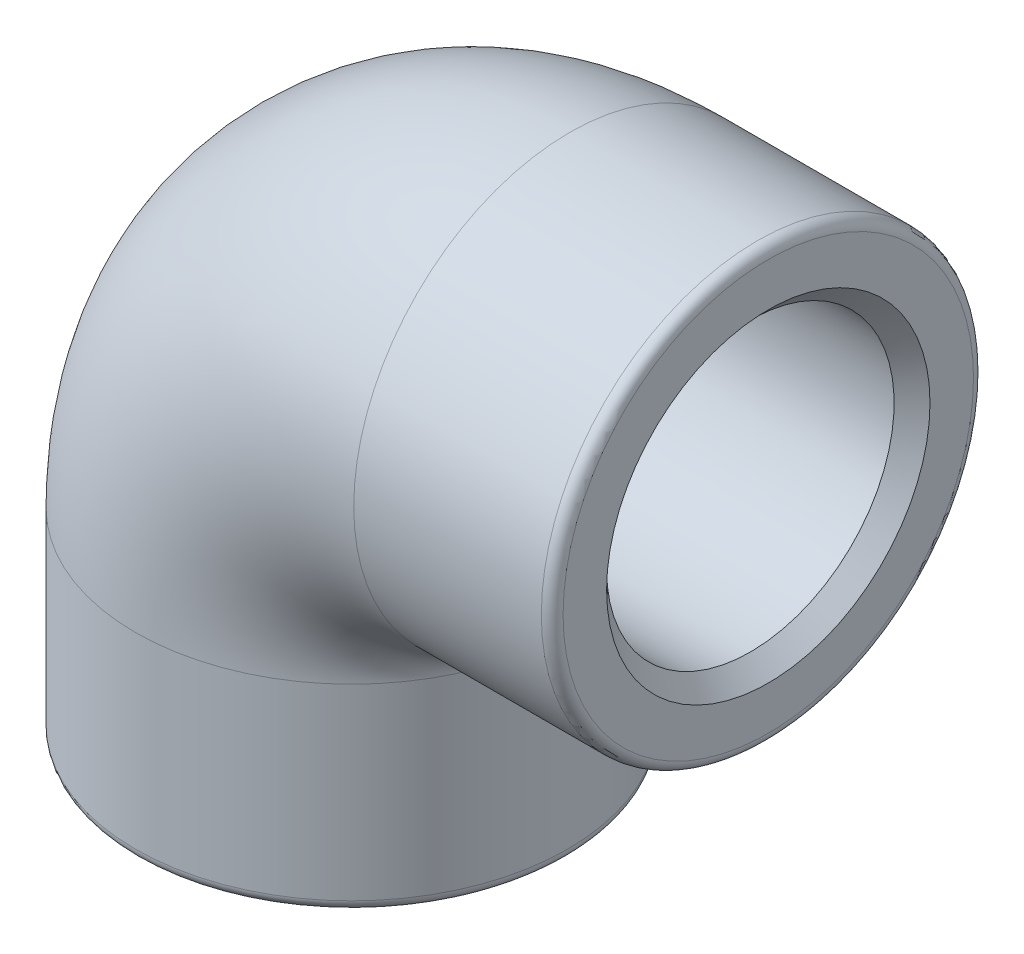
ISO-10303-21;
HEADER;
FILE_DESCRIPTION(('STEP AP214'),'2;1');
FILE_NAME('part.step','',(''),(''),'','','');
FILE_SCHEMA(('AUTOMOTIVE_DESIGN { 1 0 10303 214 1 1 1 1 }'));
ENDSEC;
DATA;
#1=APPLICATION_CONTEXT('core data for automotive mechanical design processes');
#2=APPLICATION_PROTOCOL_DEFINITION('international standard','automotive_design',2000,#1);
#3=PRODUCT_CONTEXT('',#1,'mechanical');
#4=PRODUCT('Part','Part','',(#3));
#5=PRODUCT_RELATED_PRODUCT_CATEGORY('part','',(#4));
#6=PRODUCT_DEFINITION_FORMATION('','',#4);
#7=PRODUCT_DEFINITION_CONTEXT('part definition',#1,'design');
#8=PRODUCT_DEFINITION('design','',#6,#7);
#9=PRODUCT_DEFINITION_SHAPE('','',#8);
#10=(LENGTH_UNIT() NAMED_UNIT(*) SI_UNIT(.MILLI.,.METRE.));
#11=(NAMED_UNIT(*) PLANE_ANGLE_UNIT() SI_UNIT($,.RADIAN.));
#12=(NAMED_UNIT(*) SI_UNIT($,.STERADIAN.) SOLID_ANGLE_UNIT());
#13=UNCERTAINTY_MEASURE_WITH_UNIT(LENGTH_MEASURE(1.E-05),#10,'distance_accuracy_value','');
#14=(GEOMETRIC_REPRESENTATION_CONTEXT(3) GLOBAL_UNCERTAINTY_ASSIGNED_CONTEXT((#13)) GLOBAL_UNIT_ASSIGNED_CONTEXT((#10,
#11,#12)) REPRESENTATION_CONTEXT('',''));
#15=CARTESIAN_POINT('',(0.,0.,0.));
#16=DIRECTION('',(0.,0.,1.));
#17=DIRECTION('',(1.,0.,0.));
#18=AXIS2_PLACEMENT_3D('',#15,#16,#17);
#19=CARTESIAN_POINT('',(0.,0.,0.));
#20=DIRECTION('',(0.,0.,-1.));
#21=DIRECTION('',(0.,-1.,0.));
#22=AXIS2_PLACEMENT_3D('',#19,#20,#21);
#23=TOROIDAL_SURFACE('',#22,14.14,8.38395);
#24=CARTESIAN_POINT('',(-4.64997692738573,7.34869784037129,-6.37626499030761));
#25=CARTESIAN_POINT('',(-4.60202469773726,7.28499093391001,-6.30841495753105));
#26=CARTESIAN_POINT('',(-4.55558740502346,7.22178232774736,-6.23905007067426));
#27=CARTESIAN_POINT('',(-4.46558885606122,7.0966208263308,-6.09739895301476));
#28=CARTESIAN_POINT('',(-4.42202729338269,7.03466779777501,-6.02511303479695));
#29=CARTESIAN_POINT('',(-4.29546328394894,6.85113670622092,-5.80410592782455));
#30=CARTESIAN_POINT('',(-4.21652212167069,6.73180657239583,-5.65115052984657));
#31=CARTESIAN_POINT('',(-4.06851193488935,6.50097817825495,-5.33499866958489));
#32=CARTESIAN_POINT('',(-3.99944105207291,6.38947844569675,-5.1718041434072));
#33=CARTESIAN_POINT('',(-3.87031451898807,6.17566472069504,-4.83606454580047));
#34=CARTESIAN_POINT('',(-3.81026014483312,6.07335202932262,-4.66351815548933));
#35=CARTESIAN_POINT('',(-3.69404039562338,5.87126512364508,-4.29581730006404));
#36=CARTESIAN_POINT('',(-3.63857877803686,5.77236040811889,-4.09996161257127));
#37=CARTESIAN_POINT('',(-3.53687028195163,5.58787462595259,-3.69976367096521));
#38=CARTESIAN_POINT('',(-3.49062375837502,5.5022940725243,-3.49542109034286));
#39=CARTESIAN_POINT('',(-3.40695628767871,5.345472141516,-3.07963679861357));
#40=CARTESIAN_POINT('',(-3.36953206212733,5.27422543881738,-2.86819775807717));
#41=CARTESIAN_POINT('',(-3.30323350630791,5.14683782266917,-2.43958328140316));
#42=CARTESIAN_POINT('',(-3.27435710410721,5.09069324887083,-2.22240924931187));
#43=CARTESIAN_POINT('',(-3.21535328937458,4.97527662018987,-1.69816298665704));
#44=CARTESIAN_POINT('',(-3.18911712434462,4.92329966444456,-1.38901423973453));
#45=CARTESIAN_POINT('',(-3.15263288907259,4.85081924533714,-0.766566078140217));
#46=CARTESIAN_POINT('',(-3.14235829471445,4.83026356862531,-0.453274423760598));
#47=CARTESIAN_POINT('',(-3.13930078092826,4.82414786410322,-0.0466322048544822));
#48=CARTESIAN_POINT('',(-3.13930082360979,4.82414832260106,0.0466362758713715));
#49=CARTESIAN_POINT('',(-3.14180821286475,4.82916232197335,0.380118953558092));
#50=CARTESIAN_POINT('',(-3.14826690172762,4.84207521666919,0.620265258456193));
#51=CARTESIAN_POINT('',(-3.17051993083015,4.88637668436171,1.09852042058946));
#52=CARTESIAN_POINT('',(-3.1863204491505,4.91777748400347,1.33662782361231));
#53=CARTESIAN_POINT('',(-3.22737743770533,4.99877888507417,1.80949665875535));
#54=CARTESIAN_POINT('',(-3.25265623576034,5.04842245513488,2.044248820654));
#55=CARTESIAN_POINT('',(-3.31280432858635,5.16529715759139,2.5080773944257));
#56=CARTESIAN_POINT('',(-3.34767374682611,5.2325285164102,2.73715373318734));
#57=CARTESIAN_POINT('',(-3.42624931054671,5.3818421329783,3.18228342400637));
#58=CARTESIAN_POINT('',(-3.46971151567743,5.46350898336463,3.39851935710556));
#59=CARTESIAN_POINT('',(-3.56636029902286,5.64177661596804,3.82251562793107));
#60=CARTESIAN_POINT('',(-3.61954751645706,5.73837837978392,4.03027540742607));
#61=CARTESIAN_POINT('',(-3.73619983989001,5.94526764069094,4.43584504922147));
#62=CARTESIAN_POINT('',(-3.799664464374,6.05555449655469,4.63365537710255));
#63=CARTESIAN_POINT('',(-3.93766244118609,6.28828125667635,5.01791600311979));
#64=CARTESIAN_POINT('',(-4.01219406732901,6.41071926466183,5.20436806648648));
#65=CARTESIAN_POINT('',(-4.16354035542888,6.65023583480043,5.5425179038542));
#66=CARTESIAN_POINT('',(-4.23895994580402,6.76613723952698,5.69567674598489));
#67=CARTESIAN_POINT('',(-4.4000886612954,7.00424958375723,5.99129405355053));
#68=CARTESIAN_POINT('',(-4.48579625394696,7.12645958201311,6.13375410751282));
#69=CARTESIAN_POINT('',(-4.66835078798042,7.37488219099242,6.40669001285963));
#70=CARTESIAN_POINT('',(-4.76516452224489,7.50108209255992,6.53719959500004));
#71=CARTESIAN_POINT('',(-4.97133860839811,7.75536135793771,6.78575562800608));
#72=CARTESIAN_POINT('',(-5.08068942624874,7.883439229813,6.90381142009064));
#73=CARTESIAN_POINT('',(-5.249514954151,8.06864944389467,7.06563047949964));
#74=CARTESIAN_POINT('',(-5.30351036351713,8.12622450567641,7.11467474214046));
#75=CARTESIAN_POINT('',(-5.41443214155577,8.2408303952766,7.2099858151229));
#76=CARTESIAN_POINT('',(-5.47135820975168,8.29786127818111,7.25625290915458));
#77=CARTESIAN_POINT('',(-5.52981068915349,8.35446781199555,7.30110659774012));
#78=B_SPLINE_CURVE_WITH_KNOTS('',3,(#24,#25,#26,#27,#28,#29,#30,#31,#32,#33,#34,#35,#36,#37,#38,
#39,#40,#41,#42,#43,#44,#45,#46,#47,#48,#49,#50,#51,#52,#53,#54,#55,#56,#57,#58,#59,#60,#61,#62,
#63,#64,#65,#66,#67,#68,#69,#70,#71,#72,#73,#74,#75,#76,#77),.UNSPECIFIED.,.F.,.F.,(4,2,2,2,2,2,
2,2,2,2,2,2,2,2,2,2,2,2,2,2,2,2,2,2,2,2,4),(0.,0.314042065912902,0.628050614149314,
1.25567612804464,1.88318332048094,2.51077924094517,3.18896722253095,3.86718131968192,
4.5451429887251,5.2229401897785,6.16466504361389,7.10482330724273,7.38460872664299,
8.10532897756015,8.82652640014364,9.54943351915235,10.272349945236,10.9771095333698,
11.6819154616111,12.3866883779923,13.0913514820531,13.7097977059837,14.3281519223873,
14.9447032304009,15.5607887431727,15.8394979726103,16.1181786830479),.UNSPECIFIED.);
#79=CARTESIAN_POINT('',(-3.14,4.82554646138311,-0.13962638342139));
#80=VERTEX_POINT('',#79);
#81=CARTESIAN_POINT('',(-3.14,4.82554646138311,0.139626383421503));
#82=VERTEX_POINT('',#81);
#83=EDGE_CURVE('E121',#80,#82,#78,.T.);
#84=ORIENTED_EDGE('',*,*,#83,.F.);
#85=CARTESIAN_POINT('',(-3.139999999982,7.47349180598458,5.82112649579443));
#86=CARTESIAN_POINT('',(-3.13999999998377,7.66336261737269,6.00256862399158));
#87=CARTESIAN_POINT('',(-3.13999999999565,7.86086032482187,6.17595615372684));
#88=CARTESIAN_POINT('',(-3.14000000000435,8.26971175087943,6.50552974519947));
#89=CARTESIAN_POINT('',(-3.14000000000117,8.48106372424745,6.661717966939));
#90=CARTESIAN_POINT('',(-3.13999999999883,8.91645825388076,6.95596121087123));
#91=CARTESIAN_POINT('',(-3.13999999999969,9.14051804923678,7.09399071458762));
#92=CARTESIAN_POINT('',(-3.14000000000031,9.59942759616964,7.35051607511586));
#93=CARTESIAN_POINT('',(-3.14000000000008,9.8342724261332,7.46902073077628));
#94=CARTESIAN_POINT('',(-3.13999999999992,10.3129302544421,7.68542004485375));
#95=CARTESIAN_POINT('',(-3.13999999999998,10.5567318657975,7.78333987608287));
#96=CARTESIAN_POINT('',(-3.14000000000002,11.0518669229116,7.95784410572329));
#97=CARTESIAN_POINT('',(-3.14000000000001,11.3032005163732,8.03442808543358));
#98=CARTESIAN_POINT('',(-3.13999999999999,11.8114792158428,8.16544964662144));
#99=CARTESIAN_POINT('',(-3.14,12.0684221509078,8.21989564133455));
#100=CARTESIAN_POINT('',(-3.14,12.5860926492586,8.30605071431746));
#101=CARTESIAN_POINT('',(-3.14,12.8468200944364,8.33776050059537));
#102=CARTESIAN_POINT('',(-3.14,13.3625997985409,8.37741391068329));
#103=CARTESIAN_POINT('',(-3.14,13.6176020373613,8.38600908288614));
#104=CARTESIAN_POINT('',(-3.14,14.1273949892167,8.38106077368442));
#105=CARTESIAN_POINT('',(-3.14,14.3821857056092,8.3675176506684));
#106=CARTESIAN_POINT('',(-3.14,14.889594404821,8.31822380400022));
#107=CARTESIAN_POINT('',(-3.14,15.142212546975,8.28247472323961));
#108=CARTESIAN_POINT('',(-3.14,15.6433242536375,8.18888650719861));
#109=CARTESIAN_POINT('',(-3.14,15.8918179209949,8.13104792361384));
#110=CARTESIAN_POINT('',(-3.14,16.3742979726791,7.99594672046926));
#111=CARTESIAN_POINT('',(-3.14,16.608489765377,7.91941691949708));
#112=CARTESIAN_POINT('',(-3.14,17.069420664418,7.74649642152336));
#113=CARTESIAN_POINT('',(-3.14,17.2961599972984,7.65010632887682));
#114=CARTESIAN_POINT('',(-3.14,17.740432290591,7.43809522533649));
#115=CARTESIAN_POINT('',(-3.14,17.9579663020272,7.32247641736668));
#116=CARTESIAN_POINT('',(-3.14,18.3821730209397,7.07278391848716));
#117=CARTESIAN_POINT('',(-3.14,18.5888458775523,6.93871048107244));
#118=CARTESIAN_POINT('',(-3.14,18.9848072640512,6.65655231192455));
#119=CARTESIAN_POINT('',(-3.14,19.1743974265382,6.50889068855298));
#120=CARTESIAN_POINT('',(-3.14,19.540281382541,6.19792442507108));
#121=CARTESIAN_POINT('',(-3.14,19.7165754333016,6.03462008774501));
#122=CARTESIAN_POINT('',(-3.14,20.0545242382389,5.69352838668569));
#123=CARTESIAN_POINT('',(-3.14,20.2161799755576,5.51574199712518));
#124=CARTESIAN_POINT('',(-3.14,20.5236346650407,5.14694865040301));
#125=CARTESIAN_POINT('',(-3.14,20.6694337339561,4.95594179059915));
#126=CARTESIAN_POINT('',(-3.14,20.9419557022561,4.56510957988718));
#127=CARTESIAN_POINT('',(-3.14,21.0689364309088,4.36546395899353));
#128=CARTESIAN_POINT('',(-3.14,21.3054931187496,3.95611687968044));
#129=CARTESIAN_POINT('',(-3.14,21.4150693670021,3.74641558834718));
#130=CARTESIAN_POINT('',(-3.14,21.615994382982,3.3184645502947));
#131=CARTESIAN_POINT('',(-3.14,21.7073438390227,3.10021512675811));
#132=CARTESIAN_POINT('',(-3.14,21.871134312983,2.65673237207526));
#133=CARTESIAN_POINT('',(-3.14,21.9435753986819,2.43149906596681));
#134=CARTESIAN_POINT('',(-3.14,22.06845127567,1.97768797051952));
#135=CARTESIAN_POINT('',(-3.14,22.121056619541,1.74915709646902));
#136=CARTESIAN_POINT('',(-3.14,22.2067802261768,1.28838671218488));
#137=CARTESIAN_POINT('',(-3.14,22.2398917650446,1.05614595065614));
#138=CARTESIAN_POINT('',(-3.14,22.2863485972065,0.589743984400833));
#139=CARTESIAN_POINT('',(-3.14,22.2996979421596,0.355583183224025));
#140=CARTESIAN_POINT('',(-3.14,22.3065441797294,-0.113031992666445));
#141=CARTESIAN_POINT('',(-3.14,22.3000407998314,-0.347486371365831));
#142=CARTESIAN_POINT('',(-3.14,22.2672889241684,-0.814157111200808));
#143=CARTESIAN_POINT('',(-3.14,22.241112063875,-1.04637850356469));
#144=CARTESIAN_POINT('',(-3.14,22.1692893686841,-1.50779530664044));
#145=CARTESIAN_POINT('',(-3.14,22.1236431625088,-1.73699065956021));
#146=CARTESIAN_POINT('',(-3.14,22.0132285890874,-2.19068053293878));
#147=CARTESIAN_POINT('',(-3.14,21.9484639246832,-2.41517595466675));
#148=CARTESIAN_POINT('',(-3.14,21.8002590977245,-2.85800248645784));
#149=CARTESIAN_POINT('',(-3.14,21.7168123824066,-3.07633140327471));
#150=CARTESIAN_POINT('',(-3.14,21.5318406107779,-3.50526993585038));
#151=CARTESIAN_POINT('',(-3.14,21.4303100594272,-3.71587718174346));
#152=CARTESIAN_POINT('',(-3.14,21.209881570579,-4.1279190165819));
#153=CARTESIAN_POINT('',(-3.14,21.0909758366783,-4.32934943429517));
#154=CARTESIAN_POINT('',(-3.14,20.8366988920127,-4.7215343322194));
#155=CARTESIAN_POINT('',(-3.14,20.7013276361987,-4.91228878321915));
#156=CARTESIAN_POINT('',(-3.14,20.41516780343,-5.2817229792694));
#157=CARTESIAN_POINT('',(-3.14,20.2643860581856,-5.46040801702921));
#158=CARTESIAN_POINT('',(-3.14,19.9475766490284,-5.80552401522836));
#159=CARTESIAN_POINT('',(-3.14,19.7814698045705,-5.9718822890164));
#160=CARTESIAN_POINT('',(-3.14,19.4359852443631,-6.2900694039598));
#161=CARTESIAN_POINT('',(-3.14,19.2566120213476,-6.44190312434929));
#162=CARTESIAN_POINT('',(-3.14,18.885800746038,-6.73012194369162));
#163=CARTESIAN_POINT('',(-3.14,18.6943603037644,-6.86650396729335));
#164=CARTESIAN_POINT('',(-3.14,18.3008192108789,-7.12289434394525));
#165=CARTESIAN_POINT('',(-3.14,18.0987187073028,-7.24290292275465));
#166=CARTESIAN_POINT('',(-3.14,17.6831424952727,-7.46694668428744));
#167=CARTESIAN_POINT('',(-3.14,17.4695706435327,-7.57080353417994));
#168=CARTESIAN_POINT('',(-3.14,17.0345303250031,-7.76039007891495));
#169=CARTESIAN_POINT('',(-3.14,16.813061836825,-7.84611972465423));
#170=CARTESIAN_POINT('',(-3.14,16.3637471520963,-7.99897023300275));
#171=CARTESIAN_POINT('',(-3.14,16.135899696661,-8.06608739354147));
#172=CARTESIAN_POINT('',(-3.14,15.6755307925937,-8.18132052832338));
#173=CARTESIAN_POINT('',(-3.14,15.4430108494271,-8.22944252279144));
#174=CARTESIAN_POINT('',(-3.14,14.9707395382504,-8.30718145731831));
#175=CARTESIAN_POINT('',(-3.14,14.7309327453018,-8.33646174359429));
#176=CARTESIAN_POINT('',(-3.14,14.249722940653,-8.37510856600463));
#177=CARTESIAN_POINT('',(-3.14,14.0083199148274,-8.38447492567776));
#178=CARTESIAN_POINT('',(-3.14,13.5255437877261,-8.38337963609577));
#179=CARTESIAN_POINT('',(-3.14,13.2841706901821,-8.37291646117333));
#180=CARTESIAN_POINT('',(-3.14,12.8030743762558,-8.33238802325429));
#181=CARTESIAN_POINT('',(-3.14,12.5633512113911,-8.30232215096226));
#182=CARTESIAN_POINT('',(-3.14,12.0808638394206,-8.22190806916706));
#183=CARTESIAN_POINT('',(-3.14,11.838184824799,-8.17104848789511));
#184=CARTESIAN_POINT('',(-3.14,11.3578203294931,-8.04959247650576));
#185=CARTESIAN_POINT('',(-3.14,11.1201349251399,-7.97899574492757));
#186=CARTESIAN_POINT('',(-3.14,10.6513226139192,-7.81872375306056));
#187=CARTESIAN_POINT('',(-3.14,10.4201949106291,-7.72905082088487));
#188=CARTESIAN_POINT('',(-3.14,9.96584730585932,-7.53134198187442));
#189=CARTESIAN_POINT('',(-3.14,9.74263006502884,-7.42329996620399));
#190=CARTESIAN_POINT('',(-3.14,9.29811679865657,-7.18573363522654));
#191=CARTESIAN_POINT('',(-3.14,9.07714429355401,-7.05560368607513));
#192=CARTESIAN_POINT('',(-3.14,8.64654825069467,-6.77756063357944));
#193=CARTESIAN_POINT('',(-3.14,8.43692996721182,-6.62963939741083));
#194=CARTESIAN_POINT('',(-3.14,8.03042104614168,-6.31702694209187));
#195=CARTESIAN_POINT('',(-3.14,7.83353707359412,-6.15232705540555));
#196=CARTESIAN_POINT('',(-3.14,7.45397219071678,-5.8073025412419));
#197=CARTESIAN_POINT('',(-3.14,7.27129121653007,-5.62697798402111));
#198=CARTESIAN_POINT('',(-3.14,6.91703300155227,-5.24699910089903));
#199=CARTESIAN_POINT('',(-3.14,6.74585867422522,-5.04696863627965));
#200=CARTESIAN_POINT('',(-3.14,6.42145336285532,-4.6328016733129));
#201=CARTESIAN_POINT('',(-3.14,6.26822408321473,-4.41866383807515));
#202=CARTESIAN_POINT('',(-3.14,5.98159017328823,-3.97773536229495));
#203=CARTESIAN_POINT('',(-3.14,5.84816936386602,-3.75095525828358));
#204=CARTESIAN_POINT('',(-3.14,5.60299247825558,-3.28599182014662));
#205=CARTESIAN_POINT('',(-3.14,5.49123012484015,-3.04781181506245));
#206=CARTESIAN_POINT('',(-3.14,5.31250689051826,-2.61276444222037));
#207=CARTESIAN_POINT('',(-3.14,5.2410665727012,-2.41772933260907));
#208=CARTESIAN_POINT('',(-3.14,5.11417719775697,-2.02262734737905));
#209=CARTESIAN_POINT('',(-3.14,5.0587182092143,-1.82256368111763));
#210=CARTESIAN_POINT('',(-3.14,4.96482797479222,-1.4186865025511));
#211=CARTESIAN_POINT('',(-3.14,4.92637887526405,-1.21487715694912));
#212=CARTESIAN_POINT('',(-3.14,4.8672604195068,-0.804680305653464));
#213=CARTESIAN_POINT('',(-3.14,4.84659117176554,-0.598292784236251));
#214=CARTESIAN_POINT('',(-3.14,4.82350149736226,-0.183929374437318));
#215=CARTESIAN_POINT('',(-3.14,4.82113091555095,0.0240493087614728));
#216=CARTESIAN_POINT('',(-3.14,4.8348296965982,0.439396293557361));
#217=CARTESIAN_POINT('',(-3.14,4.85089920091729,0.64676459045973));
#218=CARTESIAN_POINT('',(-3.14,4.90110175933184,1.0594589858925));
#219=CARTESIAN_POINT('',(-3.14,4.93524919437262,1.26478332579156));
#220=CARTESIAN_POINT('',(-3.14,5.02084158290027,1.67177711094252));
#221=CARTESIAN_POINT('',(-3.14000000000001,5.07228671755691,1.87344651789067));
#222=CARTESIAN_POINT('',(-3.13999999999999,5.1896445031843,2.26580634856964));
#223=CARTESIAN_POINT('',(-3.13999999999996,5.25506667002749,2.45664392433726));
#224=CARTESIAN_POINT('',(-3.14000000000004,5.40021530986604,2.8328228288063));
#225=CARTESIAN_POINT('',(-3.14000000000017,5.47994708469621,3.01816209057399));
#226=CARTESIAN_POINT('',(-3.13999999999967,5.73899778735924,3.56445309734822));
#227=CARTESIAN_POINT('',(-3.13999999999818,5.9383137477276,3.91613996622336));
#228=CARTESIAN_POINT('',(-3.14000000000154,6.34879568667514,4.5375778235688));
#229=CARTESIAN_POINT('',(-3.14000000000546,6.55354246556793,4.81165320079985));
#230=CARTESIAN_POINT('',(-3.13999999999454,6.99238328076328,5.33540862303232));
#231=CARTESIAN_POINT('',(-3.13999999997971,7.22648361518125,5.58508341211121));
#232=CARTESIAN_POINT('',(-3.139999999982,7.47349180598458,5.82112649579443));
#233=B_SPLINE_CURVE_WITH_KNOTS('',3,(#85,#86,#87,#88,#89,#90,#91,#92,#93,#94,#95,#96,#97,#98,
#99,#100,#101,#102,#103,#104,#105,#106,#107,#108,#109,#110,#111,#112,#113,#114,#115,#116,#117,
#118,#119,#120,#121,#122,#123,#124,#125,#126,#127,#128,#129,#130,#131,#132,#133,#134,#135,#136,
#137,#138,#139,#140,#141,#142,#143,#144,#145,#146,#147,#148,#149,#150,#151,#152,#153,#154,#155,
#156,#157,#158,#159,#160,#161,#162,#163,#164,#165,#166,#167,#168,#169,#170,#171,#172,#173,#174,
#175,#176,#177,#178,#179,#180,#181,#182,#183,#184,#185,#186,#187,#188,#189,#190,#191,#192,#193,
#194,#195,#196,#197,#198,#199,#200,#201,#202,#203,#204,#205,#206,#207,#208,#209,#210,#211,#212,
#213,#214,#215,#216,#217,#218,#219,#220,#221,#222,#223,#224,#225,#226,#227,#228,#229,#230,#231,
#232),.UNSPECIFIED.,.T.,.F.,(4,2,2,2,2,2,2,2,2,2,2,2,2,2,2,2,2,2,2,2,2,2,2,2,2,2,2,2,2,2,2,2,2,
2,2,2,2,2,2,2,2,2,2,2,2,2,2,2,2,2,2,2,2,2,2,2,2,2,2,2,2,2,2,2,2,2,2,2,2,2,2,2,2,4),(0.,
0.787558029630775,1.57501703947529,2.36357110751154,3.1517688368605,3.93899701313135,
4.72624063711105,5.51318479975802,6.30010445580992,7.06459801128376,7.82907919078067,
8.59350381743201,9.35790935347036,10.096143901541,10.8343559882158,11.5724835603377,
12.3106009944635,13.0306577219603,13.7507005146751,14.4706949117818,15.190684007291,
15.8996526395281,16.608609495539,17.3175395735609,18.0264671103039,18.7291520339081,
19.4320791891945,20.1348622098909,20.8376548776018,21.5379008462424,22.2381601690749,
22.9382839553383,23.6386536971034,24.339236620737,25.0401348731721,25.7410350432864,
26.4416258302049,27.1460641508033,27.8502649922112,28.5546057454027,29.2589367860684,
29.9705634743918,30.6821920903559,31.3939621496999,32.1055064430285,32.8294350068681,
33.553369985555,34.2773606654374,35.0013738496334,35.7443799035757,36.4873973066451,
37.2303240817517,37.9734984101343,38.7419476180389,39.5107494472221,40.2799504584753,
41.049148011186,41.8379969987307,42.6269208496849,43.4151967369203,44.2032438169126,
44.8257450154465,45.4478585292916,46.0693175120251,46.6907802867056,47.3139353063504,
47.9370951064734,48.5607513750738,49.1844141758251,49.7890068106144,50.3938239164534,
51.6020227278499,52.6263585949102,53.6509146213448),.UNSPECIFIED.);
#234=EDGE_CURVE('E77',#82,#80,#233,.T.);
#235=ORIENTED_EDGE('',*,*,#234,.F.);
#236=EDGE_LOOP('',(#84,#235));
#237=FACE_BOUND('',#236,.T.);
#238=CARTESIAN_POINT('',(-8.35446781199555,5.52981068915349,7.30110659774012));
#239=CARTESIAN_POINT('',(-8.29238691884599,5.46570624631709,7.2519168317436));
#240=CARTESIAN_POINT('',(-8.22979724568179,5.40343791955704,7.20102574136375));
#241=CARTESIAN_POINT('',(-8.10402319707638,5.28243501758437,7.09593040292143));
#242=CARTESIAN_POINT('',(-8.04083896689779,5.22369960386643,7.04172694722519));
#243=CARTESIAN_POINT('',(-7.85117219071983,5.05271072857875,6.87441221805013));
#244=CARTESIAN_POINT('',(-7.72438811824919,4.9454845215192,6.75644951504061));
#245=CARTESIAN_POINT('',(-7.47355755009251,4.74378239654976,6.50907029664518));
#246=CARTESIAN_POINT('',(-7.34950081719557,4.64924760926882,6.37971162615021));
#247=CARTESIAN_POINT('',(-7.10568623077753,4.47107785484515,6.10983231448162));
#248=CARTESIAN_POINT('',(-6.98592980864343,4.38744649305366,5.96930800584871));
#249=CARTESIAN_POINT('',(-6.75280696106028,4.23022023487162,5.67825932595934));
#250=CARTESIAN_POINT('',(-6.63942919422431,4.1566071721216,5.52775381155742));
#251=CARTESIAN_POINT('',(-6.42031409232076,4.01836992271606,5.21738213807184));
#252=CARTESIAN_POINT('',(-6.314575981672,3.9537448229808,5.0575169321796));
#253=CARTESIAN_POINT('',(-6.11177331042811,3.83267481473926,4.72900034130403));
#254=CARTESIAN_POINT('',(-6.01472370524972,3.77624391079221,4.56033456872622));
#255=CARTESIAN_POINT('',(-5.8305110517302,3.67114913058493,4.21535072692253));
#256=CARTESIAN_POINT('',(-5.74334869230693,3.62248579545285,4.03903212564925));
#257=CARTESIAN_POINT('',(-5.56778275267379,3.52593363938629,3.65333375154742));
#258=CARTESIAN_POINT('',(-5.4810657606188,3.47920130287,3.44289297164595));
#259=CARTESIAN_POINT('',(-5.32280282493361,3.39498952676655,3.01458267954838));
#260=CARTESIAN_POINT('',(-5.25125751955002,3.35751047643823,2.79671285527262));
#261=CARTESIAN_POINT('',(-5.12425238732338,3.29157627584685,2.35531544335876));
#262=CARTESIAN_POINT('',(-5.06877175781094,3.2631094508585,2.13179558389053));
#263=CARTESIAN_POINT('',(-4.97442413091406,3.21498230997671,1.68043956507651));
#264=CARTESIAN_POINT('',(-4.93554932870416,3.19531785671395,1.45260548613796));
#265=CARTESIAN_POINT('',(-4.88140733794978,3.16801748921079,1.04393197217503));
#266=CARTESIAN_POINT('',(-4.86284694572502,3.15869688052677,0.86363032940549));
#267=CARTESIAN_POINT('',(-4.83628498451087,3.14537278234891,0.502203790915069));
#268=CARTESIAN_POINT('',(-4.8282732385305,3.14136416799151,0.321079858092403));
#269=CARTESIAN_POINT('',(-4.82414907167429,3.13930090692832,0.046637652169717));
#270=CARTESIAN_POINT('',(-4.82414875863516,3.13930087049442,-0.0466341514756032));
#271=CARTESIAN_POINT('',(-4.82920856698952,3.14183178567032,-0.383275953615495));
#272=CARTESIAN_POINT('',(-4.84241562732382,3.14843713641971,-0.626568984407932));
#273=CARTESIAN_POINT('',(-4.88780126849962,3.17123628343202,-1.11116170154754));
#274=CARTESIAN_POINT('',(-4.9200015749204,3.18744106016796,-1.352458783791));
#275=CARTESIAN_POINT('',(-5.00135202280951,3.22868869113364,-1.82155373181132));
#276=CARTESIAN_POINT('',(-5.04978435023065,3.25335816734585,-2.04950888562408));
#277=CARTESIAN_POINT('',(-5.16326297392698,3.31175641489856,-2.50014846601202));
#278=CARTESIAN_POINT('',(-5.22831533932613,3.34548849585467,-2.72283093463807));
#279=CARTESIAN_POINT('',(-5.37436613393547,3.42228596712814,-3.16160368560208));
#280=CARTESIAN_POINT('',(-5.45538670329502,3.46536432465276,-3.37768432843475));
#281=CARTESIAN_POINT('',(-5.63232972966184,3.56118752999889,-3.80142054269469));
#282=CARTESIAN_POINT('',(-5.72825129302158,3.61393179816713,-4.00907661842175));
#283=CARTESIAN_POINT('',(-5.93444719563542,3.73001327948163,-4.41585385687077));
#284=CARTESIAN_POINT('',(-6.04481036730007,3.79341680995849,-4.61491111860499));
#285=CARTESIAN_POINT('',(-6.27784763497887,3.93136311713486,-5.00160578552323));
#286=CARTESIAN_POINT('',(-6.40052071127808,4.00590497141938,-5.18924413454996));
#287=CARTESIAN_POINT('',(-6.65632507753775,4.16724435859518,-5.55178639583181));
#288=CARTESIAN_POINT('',(-6.78945744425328,4.25404315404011,-5.72668899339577));
#289=CARTESIAN_POINT('',(-6.99516226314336,4.3944726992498,-5.97842888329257));
#290=CARTESIAN_POINT('',(-7.0647573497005,4.44300681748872,-6.06060045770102));
#291=CARTESIAN_POINT('',(-7.20558808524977,4.5437101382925,-6.22124549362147));
#292=CARTESIAN_POINT('',(-7.2768239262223,4.5958797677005,-6.2997185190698));
#293=CARTESIAN_POINT('',(-7.34869784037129,4.64997692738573,-6.3762649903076));
#294=B_SPLINE_CURVE_WITH_KNOTS('',3,(#238,#239,#240,#241,#242,#243,#244,#245,#246,#247,#248,
#249,#250,#251,#252,#253,#254,#255,#256,#257,#258,#259,#260,#261,#262,#263,#264,#265,#266,#267,
#268,#269,#270,#271,#272,#273,#274,#275,#276,#277,#278,#279,#280,#281,#282,#283,#284,#285,#286,
#287,#288,#289,#290,#291,#292,#293),.UNSPECIFIED.,.F.,.F.,(4,2,2,2,2,2,2,2,2,2,2,2,2,2,2,2,2,2,
2,2,2,2,2,2,2,2,2,4),(0.,0.305618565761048,0.611164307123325,1.22134500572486,1.82858962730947,
2.43603453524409,3.04236284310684,3.64862950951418,4.25592043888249,4.86325365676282,
5.55950434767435,6.25578432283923,6.95115858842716,7.64620566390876,8.19033178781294,
8.73393257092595,9.01371799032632,9.74389315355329,10.4749051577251,11.1771151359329,
11.8795819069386,12.5830295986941,13.2864351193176,13.9943908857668,14.702288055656,
15.4102581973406,15.7644948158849,16.1187730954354),.UNSPECIFIED.);
#295=CARTESIAN_POINT('',(-4.82554646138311,3.14,0.139626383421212));
#296=VERTEX_POINT('',#295);
#297=CARTESIAN_POINT('',(-4.82554646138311,3.14,-0.139626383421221));
#298=VERTEX_POINT('',#297);
#299=EDGE_CURVE('E73',#296,#298,#294,.T.);
#300=ORIENTED_EDGE('',*,*,#299,.F.);
#301=CARTESIAN_POINT('',(-19.8849198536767,3.14000000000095,5.86471000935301));
#302=CARTESIAN_POINT('',(-19.7168010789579,3.14000000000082,6.034361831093));
#303=CARTESIAN_POINT('',(-19.5414814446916,3.14000000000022,6.19679743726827));
#304=CARTESIAN_POINT('',(-19.1776318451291,3.13999999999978,6.50624747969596));
#305=CARTESIAN_POINT('',(-18.9890994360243,3.13999999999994,6.65325905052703));
#306=CARTESIAN_POINT('',(-18.6001358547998,3.14000000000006,6.93089380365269));
#307=CARTESIAN_POINT('',(-18.3996961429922,3.14000000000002,7.06150500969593));
#308=CARTESIAN_POINT('',(-17.9885088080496,3.13999999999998,7.30535697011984));
#309=CARTESIAN_POINT('',(-17.7777609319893,3.14,7.41859729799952));
#310=CARTESIAN_POINT('',(-17.3477248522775,3.14,7.62686763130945));
#311=CARTESIAN_POINT('',(-17.1284457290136,3.14,7.72191639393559));
#312=CARTESIAN_POINT('',(-16.6827180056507,3.14,7.89337363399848));
#313=CARTESIAN_POINT('',(-16.4562693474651,3.14,7.96978196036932));
#314=CARTESIAN_POINT('',(-15.997852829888,3.14,8.10351730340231));
#315=CARTESIAN_POINT('',(-15.7658859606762,3.14,8.16084771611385));
#316=CARTESIAN_POINT('',(-15.2980114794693,3.14,8.25616898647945));
#317=CARTESIAN_POINT('',(-15.0621037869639,3.14,8.29415944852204));
#318=CARTESIAN_POINT('',(-14.5846594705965,3.14,8.35106398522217));
#319=CARTESIAN_POINT('',(-14.343090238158,3.14,8.36970440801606));
#320=CARTESIAN_POINT('',(-13.8592410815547,3.14,8.38698402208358));
#321=CARTESIAN_POINT('',(-13.6169611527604,3.14,8.38562308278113));
#322=CARTESIAN_POINT('',(-13.1333045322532,3.14,8.363064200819));
#323=CARTESIAN_POINT('',(-12.8919279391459,3.14,8.34186415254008));
#324=CARTESIAN_POINT('',(-12.411693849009,3.14,8.27992965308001));
#325=CARTESIAN_POINT('',(-12.1728364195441,3.14,8.23919467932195));
#326=CARTESIAN_POINT('',(-11.6926423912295,3.14,8.13723637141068));
#327=CARTESIAN_POINT('',(-11.4514191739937,3.14,8.075478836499));
#328=CARTESIAN_POINT('',(-10.9748507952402,3.14,7.93239610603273));
#329=CARTESIAN_POINT('',(-10.7395057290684,3.14,7.85107059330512));
#330=CARTESIAN_POINT('',(-10.2762316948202,3.14,7.66957827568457));
#331=CARTESIAN_POINT('',(-10.0483018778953,3.14,7.56941363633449));
#332=CARTESIAN_POINT('',(-9.60118434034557,3.14,7.35101300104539));
#333=CARTESIAN_POINT('',(-9.38199955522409,3.14,7.23277100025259));
#334=CARTESIAN_POINT('',(-8.94641335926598,3.14,6.97474905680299));
#335=CARTESIAN_POINT('',(-8.73036829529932,3.14,6.83436721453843));
#336=CARTESIAN_POINT('',(-8.31048735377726,3.14,6.53621031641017));
#337=CARTESIAN_POINT('',(-8.10665719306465,3.14,6.3784272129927));
#338=CARTESIAN_POINT('',(-7.7125649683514,3.14,6.04649535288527));
#339=CARTESIAN_POINT('',(-7.52231157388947,3.14,5.87233630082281));
#340=CARTESIAN_POINT('',(-7.15689850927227,3.14,5.50884591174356));
#341=CARTESIAN_POINT('',(-6.98173856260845,3.14,5.31951485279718));
#342=CARTESIAN_POINT('',(-6.64452057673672,3.14,4.92277052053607));
#343=CARTESIAN_POINT('',(-6.482804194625,3.14,4.71506640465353));
#344=CARTESIAN_POINT('',(-6.17821888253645,3.14,4.28621550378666));
#345=CARTESIAN_POINT('',(-6.03535176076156,3.14,4.0650674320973));
#346=CARTESIAN_POINT('',(-5.77050021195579,3.14,3.6109256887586));
#347=CARTESIAN_POINT('',(-5.64849122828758,3.14,3.37794637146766));
#348=CARTESIAN_POINT('',(-5.4272617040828,3.14,2.90142993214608));
#349=CARTESIAN_POINT('',(-5.3280337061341,3.14,2.65789629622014));
#350=CARTESIAN_POINT('',(-5.17385296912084,3.14,2.21720646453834));
#351=CARTESIAN_POINT('',(-5.11396143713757,3.14,2.02176861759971));
#352=CARTESIAN_POINT('',(-5.01034147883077,3.14,1.62675507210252));
#353=CARTESIAN_POINT('',(-4.96660291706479,3.14,1.42718205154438));
#354=CARTESIAN_POINT('',(-4.89615744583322,3.14,1.02522794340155));
#355=CARTESIAN_POINT('',(-4.86943508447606,3.14,0.822849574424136));
#356=CARTESIAN_POINT('',(-4.83356365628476,3.14,0.416528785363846));
#357=CARTESIAN_POINT('',(-4.82441489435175,3.14,0.212586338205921));
#358=CARTESIAN_POINT('',(-4.823913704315,3.14,-0.195587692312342));
#359=CARTESIAN_POINT('',(-4.83258451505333,3.14,-0.399819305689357));
#360=CARTESIAN_POINT('',(-4.86755670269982,3.14,-0.806757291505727));
#361=CARTESIAN_POINT('',(-4.89385825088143,3.14,-1.00946364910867));
#362=CARTESIAN_POINT('',(-4.96352093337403,3.14,-1.41204823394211));
#363=CARTESIAN_POINT('',(-5.00689228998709,3.14,-1.61192469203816));
#364=CARTESIAN_POINT('',(-5.10980397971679,3.14,-2.00748432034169));
#365=CARTESIAN_POINT('',(-5.16935095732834,3.14,-2.20316573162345));
#366=CARTESIAN_POINT('',(-5.37059591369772,3.14,-2.78176840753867));
#367=CARTESIAN_POINT('',(-5.53504577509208,3.14,-3.1570672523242));
#368=CARTESIAN_POINT('',(-5.82065512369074,3.14,-3.69880998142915));
#369=CARTESIAN_POINT('',(-5.92240398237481,3.14,-3.87593442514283));
#370=CARTESIAN_POINT('',(-6.13803081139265,3.14,-4.22265703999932));
#371=CARTESIAN_POINT('',(-6.25190858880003,3.14,-4.39225533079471));
#372=CARTESIAN_POINT('',(-6.6476289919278,3.14,-4.94028008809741));
#373=CARTESIAN_POINT('',(-6.95410636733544,3.14,-5.30127161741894));
#374=CARTESIAN_POINT('',(-7.61824523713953,3.14,-5.97274632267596));
#375=CARTESIAN_POINT('',(-7.97593033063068,3.14,-6.28320606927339));
#376=CARTESIAN_POINT('',(-8.56349398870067,3.14,-6.72011016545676));
#377=CARTESIAN_POINT('',(-8.77871592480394,3.14,-6.86662169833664));
#378=CARTESIAN_POINT('',(-9.22062263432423,3.14,-7.14114103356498));
#379=CARTESIAN_POINT('',(-9.44730385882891,3.14,-7.26915451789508));
#380=CARTESIAN_POINT('',(-9.9107290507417,3.14,-7.50571585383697));
#381=CARTESIAN_POINT('',(-10.1474776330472,3.14,-7.61425465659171));
#382=CARTESIAN_POINT('',(-10.6292399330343,3.14,-7.81081797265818));
#383=CARTESIAN_POINT('',(-10.8742502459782,3.14,-7.89885082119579));
#384=CARTESIAN_POINT('',(-11.3713701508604,3.14,-8.05376249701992));
#385=CARTESIAN_POINT('',(-11.6234919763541,3.14,-8.12060210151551));
#386=CARTESIAN_POINT('',(-12.1325856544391,3.14,-8.23220127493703));
#387=CARTESIAN_POINT('',(-12.3895575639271,3.14,-8.27696058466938));
#388=CARTESIAN_POINT('',(-12.9064051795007,3.14,-8.34384376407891));
#389=CARTESIAN_POINT('',(-13.1662805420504,3.14,-8.36597028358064));
#390=CARTESIAN_POINT('',(-13.6869701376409,3.14,-8.38722034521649));
#391=CARTESIAN_POINT('',(-13.9477843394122,3.14,-8.3863446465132));
#392=CARTESIAN_POINT('',(-14.459317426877,3.14,-8.36183737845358));
#393=CARTESIAN_POINT('',(-14.710074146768,3.14,-8.33899198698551));
#394=CARTESIAN_POINT('',(-15.2086750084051,3.14,-8.27169719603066));
#395=CARTESIAN_POINT('',(-15.4565191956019,3.14,-8.22724813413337));
#396=CARTESIAN_POINT('',(-15.9473649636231,3.14,-8.11694248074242));
#397=CARTESIAN_POINT('',(-16.1903671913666,3.14,-8.05108876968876));
#398=CARTESIAN_POINT('',(-16.6696688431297,3.14,-7.89834450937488));
#399=CARTESIAN_POINT('',(-16.9059684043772,3.14,-7.81145439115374));
#400=CARTESIAN_POINT('',(-17.362757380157,3.14,-7.62022630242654));
#401=CARTESIAN_POINT('',(-17.5835100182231,3.14,-7.51651665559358));
#402=CARTESIAN_POINT('',(-18.0153063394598,3.14,-7.29054794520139));
#403=CARTESIAN_POINT('',(-18.2263502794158,3.14,-7.16828937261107));
#404=CARTESIAN_POINT('',(-18.6371067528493,3.14,-6.90606063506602));
#405=CARTESIAN_POINT('',(-18.8368203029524,3.14,-6.76609206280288));
#406=CARTESIAN_POINT('',(-19.223400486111,3.14,-6.46941319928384));
#407=CARTESIAN_POINT('',(-19.4102672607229,3.14,-6.31270309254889));
#408=CARTESIAN_POINT('',(-19.7659415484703,3.14,-5.98711069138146));
#409=CARTESIAN_POINT('',(-19.9350451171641,3.14,-5.81855169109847));
#410=CARTESIAN_POINT('',(-20.2582816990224,3.14,-5.467644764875));
#411=CARTESIAN_POINT('',(-20.4124149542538,3.14,-5.28529706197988));
#412=CARTESIAN_POINT('',(-20.7045425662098,3.14,-4.90811811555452));
#413=CARTESIAN_POINT('',(-20.8425378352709,3.14,-4.71328757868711));
#414=CARTESIAN_POINT('',(-21.1013542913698,3.14,-4.31253421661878));
#415=CARTESIAN_POINT('',(-21.2221755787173,3.14,-4.106611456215));
#416=CARTESIAN_POINT('',(-21.4443077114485,3.14,-3.68784102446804));
#417=CARTESIAN_POINT('',(-21.5458463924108,3.14,-3.47511417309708));
#418=CARTESIAN_POINT('',(-21.7305310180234,3.14,-3.04182135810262));
#419=CARTESIAN_POINT('',(-21.8136771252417,3.14,-2.82125546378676));
#420=CARTESIAN_POINT('',(-21.9609524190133,3.14,-2.37387683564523));
#421=CARTESIAN_POINT('',(-22.0250826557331,3.14,-2.14706444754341));
#422=CARTESIAN_POINT('',(-22.1338526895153,3.14,-1.68881326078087));
#423=CARTESIAN_POINT('',(-22.1784925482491,3.14,-1.4573744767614));
#424=CARTESIAN_POINT('',(-22.2477123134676,3.14,-0.993120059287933));
#425=CARTESIAN_POINT('',(-22.2724260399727,3.14,-0.7603243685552));
#426=CARTESIAN_POINT('',(-22.3021140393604,3.14,-0.293477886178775));
#427=CARTESIAN_POINT('',(-22.3070883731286,3.14,-0.0594270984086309));
#428=CARTESIAN_POINT('',(-22.2972600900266,3.14,0.408291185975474));
#429=CARTESIAN_POINT('',(-22.2824547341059,3.14,0.641958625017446));
#430=CARTESIAN_POINT('',(-22.2331722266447,3.14,1.10720722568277));
#431=CARTESIAN_POINT('',(-22.1986952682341,3.14,1.33878840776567));
#432=CARTESIAN_POINT('',(-22.1104004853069,3.14,1.79782022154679));
#433=CARTESIAN_POINT('',(-22.0566160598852,3.14,2.02527727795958));
#434=CARTESIAN_POINT('',(-21.9300954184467,3.14,2.47485261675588));
#435=CARTESIAN_POINT('',(-21.8573594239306,3.14,2.69697096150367));
#436=CARTESIAN_POINT('',(-21.6935189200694,3.14,3.134163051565));
#437=CARTESIAN_POINT('',(-21.6024268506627,3.13999999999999,3.34924145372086));
#438=CARTESIAN_POINT('',(-21.4025504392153,3.14000000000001,3.7709363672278));
#439=CARTESIAN_POINT('',(-21.2937689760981,3.14000000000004,3.97755424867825));
#440=CARTESIAN_POINT('',(-20.9981900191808,3.13999999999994,4.48600075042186));
#441=CARTESIAN_POINT('',(-20.800248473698,3.1399999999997,4.78143617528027));
#442=CARTESIAN_POINT('',(-20.3684742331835,3.1400000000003,5.34479192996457));
#443=CARTESIAN_POINT('',(-20.1346409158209,3.14000000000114,5.61271178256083));
#444=CARTESIAN_POINT('',(-19.8849198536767,3.14000000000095,5.86471000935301));
#445=B_SPLINE_CURVE_WITH_KNOTS('',3,(#301,#302,#303,#304,#305,#306,#307,#308,#309,#310,#311,
#312,#313,#314,#315,#316,#317,#318,#319,#320,#321,#322,#323,#324,#325,#326,#327,#328,#329,#330,
#331,#332,#333,#334,#335,#336,#337,#338,#339,#340,#341,#342,#343,#344,#345,#346,#347,#348,#349,
#350,#351,#352,#353,#354,#355,#356,#357,#358,#359,#360,#361,#362,#363,#364,#365,#366,#367,#368,
#369,#370,#371,#372,#373,#374,#375,#376,#377,#378,#379,#380,#381,#382,#383,#384,#385,#386,#387,
#388,#389,#390,#391,#392,#393,#394,#395,#396,#397,#398,#399,#400,#401,#402,#403,#404,#405,#406,
#407,#408,#409,#410,#411,#412,#413,#414,#415,#416,#417,#418,#419,#420,#421,#422,#423,#424,#425,
#426,#427,#428,#429,#430,#431,#432,#433,#434,#435,#436,#437,#438,#439,#440,#441,#442,#443,#444),
.UNSPECIFIED.,.T.,.F.,(4,2,2,2,2,2,2,2,2,2,2,2,2,2,2,2,2,2,2,2,2,2,2,2,2,2,2,2,2,2,2,2,2,2,2,2,
2,2,2,2,2,2,2,2,2,2,2,2,2,2,2,2,2,2,2,2,2,2,2,2,2,2,2,2,2,2,2,2,2,2,2,4),(0.,0.716213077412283,
1.43255897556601,2.14942497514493,2.86630857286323,3.58244896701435,4.29859516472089,
5.01461381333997,5.73064710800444,6.45667415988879,7.1827059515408,7.90881480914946,
8.63494309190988,9.38110265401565,10.1272743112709,10.8733602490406,11.6196945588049,
12.3917538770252,13.1641717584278,13.9370785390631,14.7099711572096,15.4986873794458,
16.287479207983,17.0753358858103,17.8629342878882,18.475535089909,19.0877508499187,
19.6994098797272,20.3110795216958,20.9235473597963,21.5360211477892,22.1488622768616,
22.7619555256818,23.9856721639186,24.598103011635,25.2105241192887,26.6250926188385,
28.0403151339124,28.8206000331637,29.600644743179,30.3810509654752,31.1611394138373,
31.9426632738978,32.7241963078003,33.5056378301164,34.287053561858,35.0415084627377,
35.7959515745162,36.5502932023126,37.3046193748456,38.035431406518,38.7662240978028,
39.4969511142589,40.2276700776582,40.9430997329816,41.6585178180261,42.3738954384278,
43.0892688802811,43.7955770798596,44.5018790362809,45.2081419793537,45.9144026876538,
46.6158798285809,47.3173548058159,48.0189269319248,48.7204921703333,49.4208496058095,
50.1211988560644,50.8210750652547,51.5208374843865,52.5846710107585,53.6485229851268),.UNSPECIFIED.);
#446=EDGE_CURVE('E74',#298,#296,#445,.T.);
#447=ORIENTED_EDGE('',*,*,#446,.F.);
#448=EDGE_LOOP('',(#300,#447));
#449=FACE_BOUND('',#448,.T.);
#450=ADVANCED_FACE('F43',(#237,#449),#23,.F.);
#451=CARTESIAN_POINT('',(-3.14,14.14,0.));
#452=DIRECTION('',(1.,0.,0.));
#453=DIRECTION('',(0.,0.,-1.));
#454=AXIS2_PLACEMENT_3D('',#451,#452,#453);
#455=PLANE('',#454);
#456=ORIENTED_EDGE('',*,*,#234,.T.);
#457=CARTESIAN_POINT('',(-3.14,14.14,0.));
#458=DIRECTION('',(1.,0.,0.));
#459=DIRECTION('',(0.,0.,-1.));
#460=AXIS2_PLACEMENT_3D('',#457,#458,#459);
#461=CIRCLE('',#460,9.3155);
#462=EDGE_CURVE('E64',#80,#82,#461,.T.);
#463=ORIENTED_EDGE('',*,*,#462,.T.);
#464=EDGE_LOOP('',(#456,#463));
#465=FACE_BOUND('',#464,.T.);
#466=ADVANCED_FACE('F117',(#465),#455,.T.);
#467=CARTESIAN_POINT('',(13.86,14.14,0.));
#468=DIRECTION('',(1.,0.,0.));
#469=DIRECTION('',(0.,0.,-1.));
#470=AXIS2_PLACEMENT_3D('',#467,#468,#469);
#471=CYLINDRICAL_SURFACE('',#470,9.3155);
#472=CARTESIAN_POINT('',(11.6979999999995,14.14,0.));
#473=DIRECTION('',(-1.,0.,0.));
#474=DIRECTION('',(0.,0.,1.));
#475=AXIS2_PLACEMENT_3D('',#472,#473,#474);
#476=CIRCLE('',#475,9.3155);
#477=CARTESIAN_POINT('',(11.6979999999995,14.14,9.3155));
#478=VERTEX_POINT('',#477);
#479=EDGE_CURVE('E184',#478,#478,#476,.F.);
#480=ORIENTED_EDGE('',*,*,#479,.T.);
#481=EDGE_LOOP('',(#480));
#482=FACE_BOUND('',#481,.T.);
#483=ORIENTED_EDGE('',*,*,#83,.T.);
#484=ORIENTED_EDGE('',*,*,#462,.F.);
#485=EDGE_LOOP('',(#483,#484));
#486=FACE_BOUND('',#485,.T.);
#487=ADVANCED_FACE('F112',(#482,#486),#471,.F.);
#488=CARTESIAN_POINT('',(-14.14,3.14,0.));
#489=DIRECTION('',(0.,-1.,0.));
#490=DIRECTION('',(0.,0.,-1.));
#491=AXIS2_PLACEMENT_3D('',#488,#489,#490);
#492=PLANE('',#491);
#493=ORIENTED_EDGE('',*,*,#446,.T.);
#494=CARTESIAN_POINT('',(-14.14,3.14,0.));
#495=DIRECTION('',(0.,-1.,0.));
#496=DIRECTION('',(0.,0.,-1.));
#497=AXIS2_PLACEMENT_3D('',#494,#495,#496);
#498=CIRCLE('',#497,9.3155);
#499=EDGE_CURVE('E57',#296,#298,#498,.T.);
#500=ORIENTED_EDGE('',*,*,#499,.T.);
#501=EDGE_LOOP('',(#493,#500));
#502=FACE_BOUND('',#501,.T.);
#503=ADVANCED_FACE('F82',(#502),#492,.T.);
#504=CARTESIAN_POINT('',(-14.14,-13.86,0.));
#505=DIRECTION('',(0.,-1.,0.));
#506=DIRECTION('',(0.,0.,-1.));
#507=AXIS2_PLACEMENT_3D('',#504,#505,#506);
#508=CYLINDRICAL_SURFACE('',#507,9.3155);
#509=CARTESIAN_POINT('',(-14.14,-11.6979999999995,0.));
#510=DIRECTION('',(0.,1.,0.));
#511=DIRECTION('',(0.,0.,1.));
#512=AXIS2_PLACEMENT_3D('',#509,#510,#511);
#513=CIRCLE('',#512,9.3155);
#514=CARTESIAN_POINT('',(-14.14,-11.6979999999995,-9.3155));
#515=VERTEX_POINT('',#514);
#516=EDGE_CURVE('E190',#515,#515,#513,.F.);
#517=ORIENTED_EDGE('',*,*,#516,.T.);
#518=EDGE_LOOP('',(#517));
#519=FACE_BOUND('',#518,.T.);
#520=ORIENTED_EDGE('',*,*,#299,.T.);
#521=ORIENTED_EDGE('',*,*,#499,.F.);
#522=EDGE_LOOP('',(#520,#521));
#523=FACE_BOUND('',#522,.T.);
#524=ADVANCED_FACE('F79',(#519,#523),#508,.F.);
#525=CARTESIAN_POINT('',(12.86,14.14,0.));
#526=DIRECTION('',(-1.,0.,0.));
#527=DIRECTION('',(0.,0.,1.));
#528=AXIS2_PLACEMENT_3D('',#525,#526,#527);
#529=PLANE('',#528);
#530=CARTESIAN_POINT('',(12.86,14.14,0.));
#531=DIRECTION('',(-1.,0.,0.));
#532=DIRECTION('',(0.,0.,1.));
#533=AXIS2_PLACEMENT_3D('',#530,#531,#532);
#534=CIRCLE('',#533,13.2955);
#535=CARTESIAN_POINT('',(12.86,14.14,13.2955));
#536=VERTEX_POINT('',#535);
#537=EDGE_CURVE('E193',#536,#536,#534,.F.);
#538=ORIENTED_EDGE('',*,*,#537,.T.);
#539=EDGE_LOOP('',(#538));
#540=FACE_BOUND('',#539,.T.);
#541=CARTESIAN_POINT('',(12.86,14.14,0.));
#542=DIRECTION('',(-1.,0.,0.));
#543=DIRECTION('',(0.,0.,1.));
#544=AXIS2_PLACEMENT_3D('',#541,#542,#543);
#545=CIRCLE('',#544,10.4775000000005);
#546=CARTESIAN_POINT('',(12.86,14.14,10.4775000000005));
#547=VERTEX_POINT('',#546);
#548=EDGE_CURVE('E166',#547,#547,#545,.T.);
#549=ORIENTED_EDGE('',*,*,#548,.T.);
#550=EDGE_LOOP('',(#549));
#551=FACE_BOUND('',#550,.T.);
#552=ADVANCED_FACE('F246',(#540,#551),#529,.F.);
#553=CARTESIAN_POINT('',(0.,0.,0.));
#554=DIRECTION('',(0.,0.,-1.));
#555=DIRECTION('',(0.,-1.,0.));
#556=AXIS2_PLACEMENT_3D('',#553,#554,#555);
#557=TOROIDAL_SURFACE('',#556,14.14,14.);
#558=CARTESIAN_POINT('',(-14.14,0.,0.));
#559=DIRECTION('',(0.,-1.,0.));
#560=DIRECTION('',(1.,0.,0.));
#561=AXIS2_PLACEMENT_3D('',#558,#559,#560);
#562=CIRCLE('',#561,14.);
#563=CARTESIAN_POINT('',(-28.14,0.,0.));
#564=VERTEX_POINT('',#563);
#565=EDGE_CURVE('E84',#564,#564,#562,.T.);
#566=CARTESIAN_POINT('',(0.,14.14,0.));
#567=DIRECTION('',(1.,0.,0.));
#568=DIRECTION('',(0.,1.,0.));
#569=AXIS2_PLACEMENT_3D('',#566,#567,#568);
#570=CIRCLE('',#569,14.);
#571=CARTESIAN_POINT('',(0.,28.14,0.));
#572=VERTEX_POINT('',#571);
#573=EDGE_CURVE('E90',#572,#572,#570,.T.);
#574=CARTESIAN_POINT('',(0.,0.,0.));
#575=DIRECTION('',(0.,0.,-1.));
#576=DIRECTION('',(0.,-1.,0.));
#577=AXIS2_PLACEMENT_3D('',#574,#575,#576);
#578=CIRCLE('',#577,28.14);
#579=EDGE_CURVE('',#564,#572,#578,.T.);
#580=ORIENTED_EDGE('',*,*,#565,.F.);
#581=ORIENTED_EDGE('',*,*,#573,.F.);
#582=ORIENTED_EDGE('',*,*,#579,.T.);
#583=ORIENTED_EDGE('',*,*,#579,.F.);
#584=EDGE_LOOP('',(#580,#582,#581,#583));
#585=FACE_BOUND('',#584,.T.);
#586=ADVANCED_FACE('F254',(#585),#557,.T.);
#587=CARTESIAN_POINT('',(0.,14.14,0.));
#588=DIRECTION('',(1.,0.,0.));
#589=DIRECTION('',(0.,1.,0.));
#590=AXIS2_PLACEMENT_3D('',#587,#588,#589);
#591=CYLINDRICAL_SURFACE('',#590,14.);
#592=CARTESIAN_POINT('',(12.1555,14.14,0.));
#593=DIRECTION('',(-1.,0.,0.));
#594=DIRECTION('',(0.,0.,1.));
#595=AXIS2_PLACEMENT_3D('',#592,#593,#594);
#596=CIRCLE('',#595,14.);
#597=CARTESIAN_POINT('',(12.1555,14.14,14.));
#598=VERTEX_POINT('',#597);
#599=EDGE_CURVE('E196',#598,#598,#596,.T.);
#600=ORIENTED_EDGE('',*,*,#599,.T.);
#601=EDGE_LOOP('',(#600));
#602=FACE_BOUND('',#601,.T.);
#603=ORIENTED_EDGE('',*,*,#573,.T.);
#604=EDGE_LOOP('',(#603));
#605=FACE_BOUND('',#604,.T.);
#606=ADVANCED_FACE('F262',(#602,#605),#591,.T.);
#607=CARTESIAN_POINT('',(-14.14,0.,0.));
#608=DIRECTION('',(0.,-1.,0.));
#609=DIRECTION('',(1.,0.,0.));
#610=AXIS2_PLACEMENT_3D('',#607,#608,#609);
#611=CYLINDRICAL_SURFACE('',#610,14.);
#612=CARTESIAN_POINT('',(-14.14,-12.1555,0.));
#613=DIRECTION('',(0.,1.,0.));
#614=DIRECTION('',(0.,0.,1.));
#615=AXIS2_PLACEMENT_3D('',#612,#613,#614);
#616=CIRCLE('',#615,14.);
#617=CARTESIAN_POINT('',(-14.14,-12.1555,14.));
#618=VERTEX_POINT('',#617);
#619=EDGE_CURVE('E12',#618,#618,#616,.T.);
#620=ORIENTED_EDGE('',*,*,#619,.T.);
#621=EDGE_LOOP('',(#620));
#622=FACE_BOUND('',#621,.T.);
#623=ORIENTED_EDGE('',*,*,#565,.T.);
#624=EDGE_LOOP('',(#623));
#625=FACE_BOUND('',#624,.T.);
#626=ADVANCED_FACE('F278',(#622,#625),#611,.T.);
#627=CARTESIAN_POINT('',(-14.14,-12.86,0.));
#628=DIRECTION('',(0.,1.,0.));
#629=DIRECTION('',(0.,0.,1.));
#630=AXIS2_PLACEMENT_3D('',#627,#628,#629);
#631=PLANE('',#630);
#632=CARTESIAN_POINT('',(-14.14,-12.86,0.));
#633=DIRECTION('',(0.,1.,0.));
#634=DIRECTION('',(0.,0.,1.));
#635=AXIS2_PLACEMENT_3D('',#632,#633,#634);
#636=CIRCLE('',#635,13.2955);
#637=CARTESIAN_POINT('',(-14.14,-12.86,13.2955));
#638=VERTEX_POINT('',#637);
#639=EDGE_CURVE('E51',#638,#638,#636,.F.);
#640=ORIENTED_EDGE('',*,*,#639,.T.);
#641=EDGE_LOOP('',(#640));
#642=FACE_BOUND('',#641,.T.);
#643=CARTESIAN_POINT('',(-14.14,-12.86,0.));
#644=DIRECTION('',(0.,1.,0.));
#645=DIRECTION('',(0.,0.,1.));
#646=AXIS2_PLACEMENT_3D('',#643,#644,#645);
#647=CIRCLE('',#646,10.4775000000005);
#648=CARTESIAN_POINT('',(-14.14,-12.86,-10.4775000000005));
#649=VERTEX_POINT('',#648);
#650=EDGE_CURVE('E187',#649,#649,#647,.T.);
#651=ORIENTED_EDGE('',*,*,#650,.T.);
#652=EDGE_LOOP('',(#651));
#653=FACE_BOUND('',#652,.T.);
#654=ADVANCED_FACE('F201',(#642,#653),#631,.F.);
#655=CARTESIAN_POINT('',(12.86,14.14,0.));
#656=DIRECTION('',(1.,0.,0.));
#657=DIRECTION('',(0.,0.,-1.));
#658=AXIS2_PLACEMENT_3D('',#655,#656,#657);
#659=CONICAL_SURFACE('',#658,10.4775000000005,0.785398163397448);
#660=ORIENTED_EDGE('',*,*,#479,.F.);
#661=EDGE_LOOP('',(#660));
#662=FACE_BOUND('',#661,.T.);
#663=ORIENTED_EDGE('',*,*,#548,.F.);
#664=EDGE_LOOP('',(#663));
#665=FACE_BOUND('',#664,.T.);
#666=ADVANCED_FACE('F292',(#662,#665),#659,.F.);
#667=CARTESIAN_POINT('',(-14.14,-12.86,0.));
#668=DIRECTION('',(0.,-1.,0.));
#669=DIRECTION('',(0.,0.,-1.));
#670=AXIS2_PLACEMENT_3D('',#667,#668,#669);
#671=CONICAL_SURFACE('',#670,10.4775000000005,0.785398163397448);
#672=CARTESIAN_POINT('',(-14.14,-11.6979999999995,-9.3155));
#673=CARTESIAN_POINT('',(-14.14,-11.7101041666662,-9.32760416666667));
#674=CARTESIAN_POINT('',(-14.14,-11.7222083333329,-9.33970833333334));
#675=CARTESIAN_POINT('',(-14.14,-11.7464166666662,-9.36391666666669));
#676=CARTESIAN_POINT('',(-14.14,-11.7585208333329,-9.37602083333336));
#677=CARTESIAN_POINT('',(-14.14,-11.7827291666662,-9.4002291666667));
#678=CARTESIAN_POINT('',(-14.14,-11.7948333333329,-9.41233333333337));
#679=CARTESIAN_POINT('',(-14.14,-11.8190416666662,-9.43654166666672));
#680=CARTESIAN_POINT('',(-14.14,-11.8311458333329,-9.44864583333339));
#681=CARTESIAN_POINT('',(-14.14,-11.8553541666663,-9.47285416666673));
#682=CARTESIAN_POINT('',(-14.14,-11.8674583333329,-9.4849583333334));
#683=CARTESIAN_POINT('',(-14.14,-11.8916666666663,-9.50916666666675));
#684=CARTESIAN_POINT('',(-14.14,-11.9037708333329,-9.52127083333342));
#685=CARTESIAN_POINT('',(-14.14,-11.9279791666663,-9.54547916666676));
#686=CARTESIAN_POINT('',(-14.14,-11.940083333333,-9.55758333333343));
#687=CARTESIAN_POINT('',(-14.14,-11.9642916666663,-9.58179166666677));
#688=CARTESIAN_POINT('',(-14.14,-11.976395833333,-9.59389583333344));
#689=CARTESIAN_POINT('',(-14.14,-12.0006041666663,-9.61810416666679));
#690=CARTESIAN_POINT('',(-14.14,-12.012708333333,-9.63020833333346));
#691=CARTESIAN_POINT('',(-14.14,-12.0369166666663,-9.6544166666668));
#692=CARTESIAN_POINT('',(-14.14,-12.049020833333,-9.66652083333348));
#693=CARTESIAN_POINT('',(-14.14,-12.0732291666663,-9.69072916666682));
#694=CARTESIAN_POINT('',(-14.14,-12.085333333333,-9.70283333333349));
#695=CARTESIAN_POINT('',(-14.14,-12.1095416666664,-9.72704166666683));
#696=CARTESIAN_POINT('',(-14.14,-12.121645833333,-9.73914583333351));
#697=CARTESIAN_POINT('',(-14.14,-12.1458541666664,-9.76335416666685));
#698=CARTESIAN_POINT('',(-14.14,-12.157958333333,-9.77545833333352));
#699=CARTESIAN_POINT('',(-14.14,-12.1821666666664,-9.79966666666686));
#700=CARTESIAN_POINT('',(-14.14,-12.1942708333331,-9.81177083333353));
#701=CARTESIAN_POINT('',(-14.14,-12.2184791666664,-9.83597916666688));
#702=CARTESIAN_POINT('',(-14.14,-12.2305833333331,-9.84808333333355));
#703=CARTESIAN_POINT('',(-14.14,-12.2547916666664,-9.87229166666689));
#704=CARTESIAN_POINT('',(-14.14,-12.2668958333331,-9.88439583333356));
#705=CARTESIAN_POINT('',(-14.14,-12.2911041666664,-9.90860416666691));
#706=CARTESIAN_POINT('',(-14.14,-12.3032083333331,-9.92070833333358));
#707=CARTESIAN_POINT('',(-14.14,-12.3274166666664,-9.94491666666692));
#708=CARTESIAN_POINT('',(-14.14,-12.3395208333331,-9.95702083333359));
#709=CARTESIAN_POINT('',(-14.14,-12.3637291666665,-9.98122916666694));
#710=CARTESIAN_POINT('',(-14.14,-12.3758333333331,-9.99333333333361));
#711=CARTESIAN_POINT('',(-14.14,-12.4000416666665,-10.017541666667));
#712=CARTESIAN_POINT('',(-14.14,-12.4121458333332,-10.0296458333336));
#713=CARTESIAN_POINT('',(-14.14,-12.4363541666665,-10.053854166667));
#714=CARTESIAN_POINT('',(-14.14,-12.4484583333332,-10.0659583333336));
#715=CARTESIAN_POINT('',(-14.14,-12.4726666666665,-10.090166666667));
#716=CARTESIAN_POINT('',(-14.14,-12.4847708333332,-10.1022708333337));
#717=CARTESIAN_POINT('',(-14.14,-12.5089791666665,-10.126479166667));
#718=CARTESIAN_POINT('',(-14.14,-12.5210833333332,-10.1385833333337));
#719=CARTESIAN_POINT('',(-14.14,-12.5452916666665,-10.162791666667));
#720=CARTESIAN_POINT('',(-14.14,-12.5573958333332,-10.1748958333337));
#721=CARTESIAN_POINT('',(-14.14,-12.5816041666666,-10.199104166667));
#722=CARTESIAN_POINT('',(-14.14,-12.5937083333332,-10.2112083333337));
#723=CARTESIAN_POINT('',(-14.14,-12.6179166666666,-10.235416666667));
#724=CARTESIAN_POINT('',(-14.14,-12.6300208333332,-10.2475208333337));
#725=CARTESIAN_POINT('',(-14.14,-12.6542291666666,-10.2717291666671));
#726=CARTESIAN_POINT('',(-14.14,-12.6663333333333,-10.2838333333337));
#727=CARTESIAN_POINT('',(-14.14,-12.6905416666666,-10.3080416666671));
#728=CARTESIAN_POINT('',(-14.14,-12.7026458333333,-10.3201458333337));
#729=CARTESIAN_POINT('',(-14.14,-12.7268541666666,-10.3443541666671));
#730=CARTESIAN_POINT('',(-14.14,-12.7389583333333,-10.3564583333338));
#731=CARTESIAN_POINT('',(-14.14,-12.7631666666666,-10.3806666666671));
#732=CARTESIAN_POINT('',(-14.14,-12.7752708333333,-10.3927708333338));
#733=CARTESIAN_POINT('',(-14.14,-12.7994791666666,-10.4169791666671));
#734=CARTESIAN_POINT('',(-14.14,-12.8115833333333,-10.4290833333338));
#735=CARTESIAN_POINT('',(-14.14,-12.8357916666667,-10.4532916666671));
#736=CARTESIAN_POINT('',(-14.14,-12.8478958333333,-10.4653958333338));
#737=CARTESIAN_POINT('',(-14.14,-12.86,-10.4775000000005));
#738=B_SPLINE_CURVE_WITH_KNOTS('',3,(#672,#673,#674,#675,#676,#677,#678,#679,#680,#681,#682,
#683,#684,#685,#686,#687,#688,#689,#690,#691,#692,#693,#694,#695,#696,#697,#698,#699,#700,#701,
#702,#703,#704,#705,#706,#707,#708,#709,#710,#711,#712,#713,#714,#715,#716,#717,#718,#719,#720,
#721,#722,#723,#724,#725,#726,#727,#728,#729,#730,#731,#732,#733,#734,#735,#736,#737),
.UNSPECIFIED.,.F.,.F.,(4,2,2,2,2,2,2,2,2,2,2,2,2,2,2,2,2,2,2,2,2,2,2,2,2,2,2,2,2,2,2,2,4),(0.,
0.0513536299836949,0.102707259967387,0.154060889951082,0.205414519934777,0.25676814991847,
0.308121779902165,0.359475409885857,0.410829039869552,0.462182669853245,0.513536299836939,
0.564889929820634,0.616243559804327,0.667597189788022,0.718950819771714,0.770304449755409,
0.821658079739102,0.873011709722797,0.924365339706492,0.975718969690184,1.02707259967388,
1.07842622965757,1.12977985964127,1.18113348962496,1.23248711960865,1.28384074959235,
1.33519437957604,1.38654800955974,1.43790163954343,1.48925526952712,1.54060889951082,
1.59196252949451,1.64331615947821),.UNSPECIFIED.);
#739=EDGE_CURVE('BSEAM210',#515,#649,#738,.T.);
#740=ORIENTED_EDGE('',*,*,#516,.F.);
#741=ORIENTED_EDGE('',*,*,#650,.F.);
#742=ORIENTED_EDGE('',*,*,#739,.T.);
#743=ORIENTED_EDGE('',*,*,#739,.F.);
#744=EDGE_LOOP('',(#740,#742,#741,#743));
#745=FACE_BOUND('',#744,.T.);
#746=ADVANCED_FACE('F210',(#745),#671,.F.);
#747=CARTESIAN_POINT('',(12.1555,14.14,0.));
#748=DIRECTION('',(-1.,0.,0.));
#749=DIRECTION('',(0.,0.,1.));
#750=AXIS2_PLACEMENT_3D('',#747,#748,#749);
#751=TOROIDAL_SURFACE('',#750,13.2955,0.7045);
#752=ORIENTED_EDGE('',*,*,#599,.F.);
#753=EDGE_LOOP('',(#752));
#754=FACE_BOUND('',#753,.T.);
#755=ORIENTED_EDGE('',*,*,#537,.F.);
#756=EDGE_LOOP('',(#755));
#757=FACE_BOUND('',#756,.T.);
#758=ADVANCED_FACE('F205',(#754,#757),#751,.T.);
#759=CARTESIAN_POINT('',(-14.14,-12.1555,0.));
#760=DIRECTION('',(0.,1.,0.));
#761=DIRECTION('',(0.,0.,1.));
#762=AXIS2_PLACEMENT_3D('',#759,#760,#761);
#763=TOROIDAL_SURFACE('',#762,13.2955,0.7045);
#764=ORIENTED_EDGE('',*,*,#619,.F.);
#765=EDGE_LOOP('',(#764));
#766=FACE_BOUND('',#765,.T.);
#767=ORIENTED_EDGE('',*,*,#639,.F.);
#768=EDGE_LOOP('',(#767));
#769=FACE_BOUND('',#768,.T.);
#770=ADVANCED_FACE('F45',(#766,#769),#763,.T.);
#771=CLOSED_SHELL('',(#450,#466,#487,#503,#524,#552,#586,#606,#626,#654,#666,#746,#758,#770));
#772=MANIFOLD_SOLID_BREP('B2',#771);
#773=ADVANCED_BREP_SHAPE_REPRESENTATION('',(#18,#772),#14);
#774=SHAPE_DEFINITION_REPRESENTATION(#9,#773);
ENDSEC;
END-ISO-10303-21;
